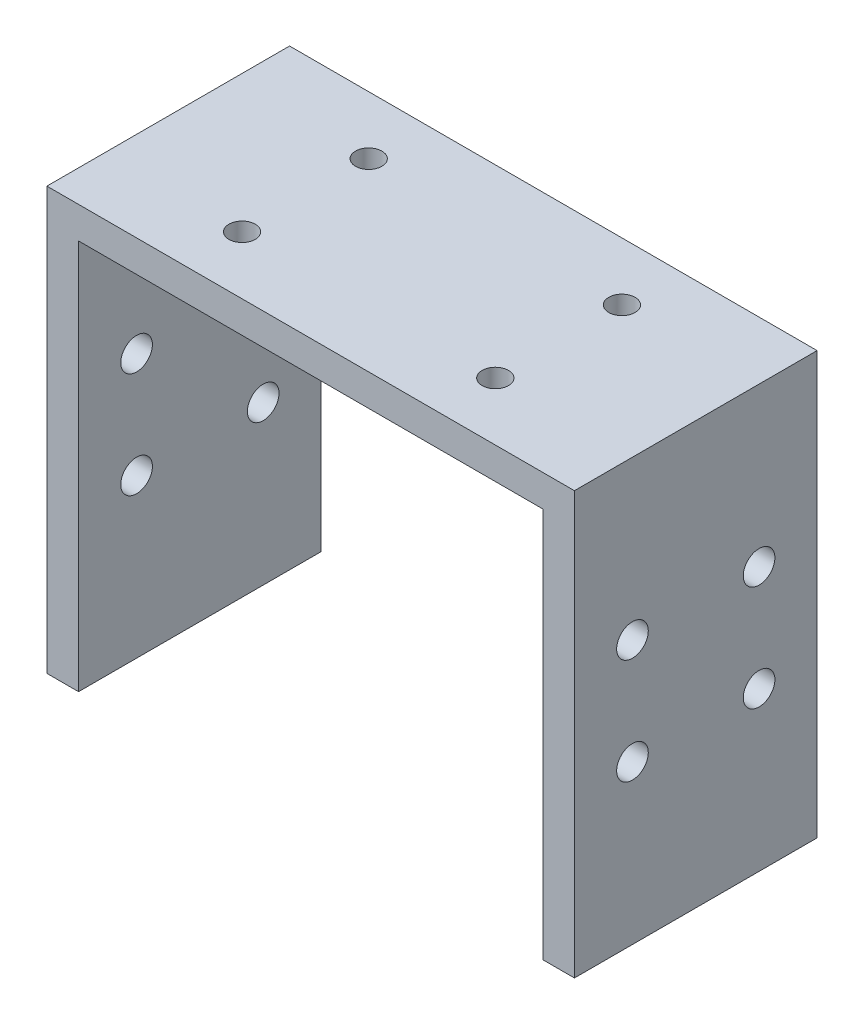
ISO-10303-21;
HEADER;
FILE_DESCRIPTION(('STEP AP214'),'2;1');
FILE_NAME('part.step','',(''),(''),'','','');
FILE_SCHEMA(('AUTOMOTIVE_DESIGN { 1 0 10303 214 1 1 1 1 }'));
ENDSEC;
DATA;
#1=APPLICATION_CONTEXT('core data for automotive mechanical design processes');
#2=APPLICATION_PROTOCOL_DEFINITION('international standard','automotive_design',2000,#1);
#3=PRODUCT_CONTEXT('',#1,'mechanical');
#4=PRODUCT('Part','Part','',(#3));
#5=PRODUCT_RELATED_PRODUCT_CATEGORY('part','',(#4));
#6=PRODUCT_DEFINITION_FORMATION('','',#4);
#7=PRODUCT_DEFINITION_CONTEXT('part definition',#1,'design');
#8=PRODUCT_DEFINITION('design','',#6,#7);
#9=PRODUCT_DEFINITION_SHAPE('','',#8);
#10=(LENGTH_UNIT() NAMED_UNIT(*) SI_UNIT(.MILLI.,.METRE.));
#11=(NAMED_UNIT(*) PLANE_ANGLE_UNIT() SI_UNIT($,.RADIAN.));
#12=(NAMED_UNIT(*) SI_UNIT($,.STERADIAN.) SOLID_ANGLE_UNIT());
#13=UNCERTAINTY_MEASURE_WITH_UNIT(LENGTH_MEASURE(1.E-05),#10,'distance_accuracy_value','');
#14=(GEOMETRIC_REPRESENTATION_CONTEXT(3) GLOBAL_UNCERTAINTY_ASSIGNED_CONTEXT((#13)) GLOBAL_UNIT_ASSIGNED_CONTEXT((#10,
#11,#12)) REPRESENTATION_CONTEXT('',''));
#15=CARTESIAN_POINT('',(0.,0.,0.));
#16=DIRECTION('',(0.,0.,1.));
#17=DIRECTION('',(1.,0.,0.));
#18=AXIS2_PLACEMENT_3D('',#15,#16,#17);
#19=CARTESIAN_POINT('',(-25.,-40.,11.5));
#20=DIRECTION('',(0.,0.,1.));
#21=DIRECTION('',(1.,0.,0.));
#22=AXIS2_PLACEMENT_3D('',#19,#20,#21);
#23=PLANE('',#22);
#24=DIRECTION('',(1.,0.,0.));
#25=VECTOR('',#24,1.);
#26=CARTESIAN_POINT('',(-25.,-40.,11.5));
#27=LINE('',#26,#25);
#28=CARTESIAN_POINT('',(-25.,-40.,11.5));
#29=VERTEX_POINT('',#28);
#30=CARTESIAN_POINT('',(-22.,-40.,11.5));
#31=VERTEX_POINT('',#30);
#32=EDGE_CURVE('E157',#29,#31,#27,.T.);
#33=ORIENTED_EDGE('',*,*,#32,.T.);
#34=DIRECTION('',(0.,1.,0.));
#35=VECTOR('',#34,1.);
#36=CARTESIAN_POINT('',(-22.,-40.,11.5));
#37=LINE('',#36,#35);
#38=CARTESIAN_POINT('',(-22.,-3.,11.5));
#39=VERTEX_POINT('',#38);
#40=EDGE_CURVE('E58',#31,#39,#37,.T.);
#41=ORIENTED_EDGE('',*,*,#40,.T.);
#42=DIRECTION('',(1.,0.,0.));
#43=VECTOR('',#42,1.);
#44=CARTESIAN_POINT('',(-25.,-3.,11.5));
#45=LINE('',#44,#43);
#46=CARTESIAN_POINT('',(22.,-3.,11.5));
#47=VERTEX_POINT('',#46);
#48=EDGE_CURVE('E128',#39,#47,#45,.T.);
#49=ORIENTED_EDGE('',*,*,#48,.T.);
#50=DIRECTION('',(0.,1.,0.));
#51=VECTOR('',#50,1.);
#52=CARTESIAN_POINT('',(22.,-40.,11.5));
#53=LINE('',#52,#51);
#54=CARTESIAN_POINT('',(22.,-40.,11.5));
#55=VERTEX_POINT('',#54);
#56=EDGE_CURVE('E114',#55,#47,#53,.T.);
#57=ORIENTED_EDGE('',*,*,#56,.F.);
#58=CARTESIAN_POINT('',(25.,-40.,11.5));
#59=VERTEX_POINT('',#58);
#60=EDGE_CURVE('E66',#55,#59,#27,.T.);
#61=ORIENTED_EDGE('',*,*,#60,.T.);
#62=DIRECTION('',(0.,1.,0.));
#63=VECTOR('',#62,1.);
#64=CARTESIAN_POINT('',(25.,-40.,11.5));
#65=LINE('',#64,#63);
#66=CARTESIAN_POINT('',(25.,0.,11.5));
#67=VERTEX_POINT('',#66);
#68=EDGE_CURVE('E11',#59,#67,#65,.T.);
#69=ORIENTED_EDGE('',*,*,#68,.T.);
#70=DIRECTION('',(1.,0.,0.));
#71=VECTOR('',#70,1.);
#72=CARTESIAN_POINT('',(-25.,0.,11.5));
#73=LINE('',#72,#71);
#74=CARTESIAN_POINT('',(-25.,0.,11.5));
#75=VERTEX_POINT('',#74);
#76=EDGE_CURVE('E151',#75,#67,#73,.T.);
#77=ORIENTED_EDGE('',*,*,#76,.F.);
#78=DIRECTION('',(0.,1.,0.));
#79=VECTOR('',#78,1.);
#80=CARTESIAN_POINT('',(-25.,-40.,11.5));
#81=LINE('',#80,#79);
#82=EDGE_CURVE('E50',#29,#75,#81,.T.);
#83=ORIENTED_EDGE('',*,*,#82,.F.);
#84=EDGE_LOOP('',(#33,#41,#49,#57,#61,#69,#77,#83));
#85=FACE_BOUND('',#84,.T.);
#86=ADVANCED_FACE('F41',(#85),#23,.T.);
#87=CARTESIAN_POINT('',(-25.,-40.,-11.5));
#88=DIRECTION('',(0.,0.,-1.));
#89=DIRECTION('',(-1.,0.,0.));
#90=AXIS2_PLACEMENT_3D('',#87,#88,#89);
#91=PLANE('',#90);
#92=DIRECTION('',(-1.,0.,0.));
#93=VECTOR('',#92,1.);
#94=CARTESIAN_POINT('',(-25.,-40.,-11.5));
#95=LINE('',#94,#93);
#96=CARTESIAN_POINT('',(25.,-40.,-11.5));
#97=VERTEX_POINT('',#96);
#98=CARTESIAN_POINT('',(22.,-40.,-11.5));
#99=VERTEX_POINT('',#98);
#100=EDGE_CURVE('E152',#97,#99,#95,.T.);
#101=ORIENTED_EDGE('',*,*,#100,.T.);
#102=DIRECTION('',(0.,1.,0.));
#103=VECTOR('',#102,1.);
#104=CARTESIAN_POINT('',(22.,-40.,-11.5));
#105=LINE('',#104,#103);
#106=CARTESIAN_POINT('',(22.,-3.,-11.5));
#107=VERTEX_POINT('',#106);
#108=EDGE_CURVE('E143',#99,#107,#105,.T.);
#109=ORIENTED_EDGE('',*,*,#108,.T.);
#110=DIRECTION('',(-1.,0.,0.));
#111=VECTOR('',#110,1.);
#112=CARTESIAN_POINT('',(-25.,-3.,-11.5));
#113=LINE('',#112,#111);
#114=CARTESIAN_POINT('',(-22.,-3.,-11.5));
#115=VERTEX_POINT('',#114);
#116=EDGE_CURVE('E130',#107,#115,#113,.T.);
#117=ORIENTED_EDGE('',*,*,#116,.T.);
#118=DIRECTION('',(0.,1.,0.));
#119=VECTOR('',#118,1.);
#120=CARTESIAN_POINT('',(-22.,-40.,-11.5));
#121=LINE('',#120,#119);
#122=CARTESIAN_POINT('',(-22.,-40.,-11.5));
#123=VERTEX_POINT('',#122);
#124=EDGE_CURVE('E141',#123,#115,#121,.T.);
#125=ORIENTED_EDGE('',*,*,#124,.F.);
#126=CARTESIAN_POINT('',(-25.,-40.,-11.5));
#127=VERTEX_POINT('',#126);
#128=EDGE_CURVE('E150',#123,#127,#95,.T.);
#129=ORIENTED_EDGE('',*,*,#128,.T.);
#130=DIRECTION('',(0.,1.,0.));
#131=VECTOR('',#130,1.);
#132=CARTESIAN_POINT('',(-25.,-40.,-11.5));
#133=LINE('',#132,#131);
#134=CARTESIAN_POINT('',(-25.,0.,-11.5));
#135=VERTEX_POINT('',#134);
#136=EDGE_CURVE('E170',#127,#135,#133,.T.);
#137=ORIENTED_EDGE('',*,*,#136,.T.);
#138=DIRECTION('',(-1.,0.,0.));
#139=VECTOR('',#138,1.);
#140=CARTESIAN_POINT('',(-25.,0.,-11.5));
#141=LINE('',#140,#139);
#142=CARTESIAN_POINT('',(25.,0.,-11.5));
#143=VERTEX_POINT('',#142);
#144=EDGE_CURVE('E161',#143,#135,#141,.T.);
#145=ORIENTED_EDGE('',*,*,#144,.F.);
#146=DIRECTION('',(0.,1.,0.));
#147=VECTOR('',#146,1.);
#148=CARTESIAN_POINT('',(25.,-40.,-11.5));
#149=LINE('',#148,#147);
#150=EDGE_CURVE('E91',#97,#143,#149,.T.);
#151=ORIENTED_EDGE('',*,*,#150,.F.);
#152=EDGE_LOOP('',(#101,#109,#117,#125,#129,#137,#145,#151));
#153=FACE_BOUND('',#152,.T.);
#154=ADVANCED_FACE('F238',(#153),#91,.T.);
#155=CARTESIAN_POINT('',(0.,-40.,0.));
#156=DIRECTION('',(0.,-1.,0.));
#157=DIRECTION('',(0.,0.,-1.));
#158=AXIS2_PLACEMENT_3D('',#155,#156,#157);
#159=PLANE('',#158);
#160=ORIENTED_EDGE('',*,*,#60,.F.);
#161=DIRECTION('',(0.,0.,-1.));
#162=VECTOR('',#161,1.);
#163=CARTESIAN_POINT('',(22.,-40.,11.5));
#164=LINE('',#163,#162);
#165=EDGE_CURVE('E120',#55,#99,#164,.T.);
#166=ORIENTED_EDGE('',*,*,#165,.T.);
#167=ORIENTED_EDGE('',*,*,#100,.F.);
#168=DIRECTION('',(0.,0.,-1.));
#169=VECTOR('',#168,1.);
#170=CARTESIAN_POINT('',(25.,-40.,11.5));
#171=LINE('',#170,#169);
#172=EDGE_CURVE('E147',#59,#97,#171,.T.);
#173=ORIENTED_EDGE('',*,*,#172,.F.);
#174=EDGE_LOOP('',(#160,#166,#167,#173));
#175=FACE_BOUND('',#174,.T.);
#176=ADVANCED_FACE('F250',(#175),#159,.T.);
#177=ORIENTED_EDGE('',*,*,#128,.F.);
#178=DIRECTION('',(0.,0.,1.));
#179=VECTOR('',#178,1.);
#180=CARTESIAN_POINT('',(-22.,-40.,11.5));
#181=LINE('',#180,#179);
#182=EDGE_CURVE('E136',#123,#31,#181,.T.);
#183=ORIENTED_EDGE('',*,*,#182,.T.);
#184=ORIENTED_EDGE('',*,*,#32,.F.);
#185=DIRECTION('',(0.,0.,1.));
#186=VECTOR('',#185,1.);
#187=CARTESIAN_POINT('',(-25.,-40.,11.5));
#188=LINE('',#187,#186);
#189=EDGE_CURVE('E154',#127,#29,#188,.T.);
#190=ORIENTED_EDGE('',*,*,#189,.F.);
#191=EDGE_LOOP('',(#177,#183,#184,#190));
#192=FACE_BOUND('',#191,.T.);
#193=ADVANCED_FACE('F247',(#192),#159,.T.);
#194=CARTESIAN_POINT('',(25.,-40.,11.5));
#195=DIRECTION('',(1.,0.,0.));
#196=DIRECTION('',(0.,0.,-1.));
#197=AXIS2_PLACEMENT_3D('',#194,#195,#196);
#198=PLANE('',#197);
#199=CARTESIAN_POINT('',(25.,-15.,-6.));
#200=DIRECTION('',(1.,0.,0.));
#201=DIRECTION('',(0.,0.,-1.));
#202=AXIS2_PLACEMENT_3D('',#199,#200,#201);
#203=CIRCLE('',#202,1.5);
#204=CARTESIAN_POINT('',(25.,-15.,-7.5));
#205=VERTEX_POINT('',#204);
#206=EDGE_CURVE('E287',#205,#205,#203,.T.);
#207=ORIENTED_EDGE('',*,*,#206,.F.);
#208=EDGE_LOOP('',(#207));
#209=FACE_BOUND('',#208,.T.);
#210=CARTESIAN_POINT('',(25.,-25.,6.));
#211=DIRECTION('',(1.,0.,0.));
#212=DIRECTION('',(0.,0.,-1.));
#213=AXIS2_PLACEMENT_3D('',#210,#211,#212);
#214=CIRCLE('',#213,1.5);
#215=CARTESIAN_POINT('',(25.,-25.,4.5));
#216=VERTEX_POINT('',#215);
#217=EDGE_CURVE('E290',#216,#216,#214,.T.);
#218=ORIENTED_EDGE('',*,*,#217,.F.);
#219=EDGE_LOOP('',(#218));
#220=FACE_BOUND('',#219,.T.);
#221=CARTESIAN_POINT('',(25.,-25.,-6.));
#222=DIRECTION('',(1.,0.,0.));
#223=DIRECTION('',(0.,0.,-1.));
#224=AXIS2_PLACEMENT_3D('',#221,#222,#223);
#225=CIRCLE('',#224,1.5);
#226=CARTESIAN_POINT('',(25.,-25.,-7.5));
#227=VERTEX_POINT('',#226);
#228=EDGE_CURVE('E291',#227,#227,#225,.T.);
#229=ORIENTED_EDGE('',*,*,#228,.F.);
#230=EDGE_LOOP('',(#229));
#231=FACE_BOUND('',#230,.T.);
#232=CARTESIAN_POINT('',(25.,-15.,6.));
#233=DIRECTION('',(1.,0.,0.));
#234=DIRECTION('',(0.,0.,-1.));
#235=AXIS2_PLACEMENT_3D('',#232,#233,#234);
#236=CIRCLE('',#235,1.5);
#237=CARTESIAN_POINT('',(25.,-15.,4.5));
#238=VERTEX_POINT('',#237);
#239=EDGE_CURVE('E284',#238,#238,#236,.T.);
#240=ORIENTED_EDGE('',*,*,#239,.F.);
#241=EDGE_LOOP('',(#240));
#242=FACE_BOUND('',#241,.T.);
#243=DIRECTION('',(0.,0.,-1.));
#244=VECTOR('',#243,1.);
#245=CARTESIAN_POINT('',(25.,0.,11.5));
#246=LINE('',#245,#244);
#247=EDGE_CURVE('E122',#67,#143,#246,.T.);
#248=ORIENTED_EDGE('',*,*,#247,.F.);
#249=ORIENTED_EDGE('',*,*,#68,.F.);
#250=ORIENTED_EDGE('',*,*,#172,.T.);
#251=ORIENTED_EDGE('',*,*,#150,.T.);
#252=EDGE_LOOP('',(#248,#249,#250,#251));
#253=FACE_BOUND('',#252,.T.);
#254=ADVANCED_FACE('F43',(#209,#220,#231,#242,#253),#198,.T.);
#255=CARTESIAN_POINT('',(-25.,-40.,11.5));
#256=DIRECTION('',(-1.,0.,0.));
#257=DIRECTION('',(0.,0.,1.));
#258=AXIS2_PLACEMENT_3D('',#255,#256,#257);
#259=PLANE('',#258);
#260=CARTESIAN_POINT('',(-25.,-15.,-6.));
#261=DIRECTION('',(1.,0.,0.));
#262=DIRECTION('',(0.,0.,-1.));
#263=AXIS2_PLACEMENT_3D('',#260,#261,#262);
#264=CIRCLE('',#263,1.5);
#265=CARTESIAN_POINT('',(-25.,-15.,-7.5));
#266=VERTEX_POINT('',#265);
#267=EDGE_CURVE('E272',#266,#266,#264,.T.);
#268=ORIENTED_EDGE('',*,*,#267,.T.);
#269=EDGE_LOOP('',(#268));
#270=FACE_BOUND('',#269,.T.);
#271=CARTESIAN_POINT('',(-25.,-25.,6.));
#272=DIRECTION('',(1.,0.,0.));
#273=DIRECTION('',(0.,0.,-1.));
#274=AXIS2_PLACEMENT_3D('',#271,#272,#273);
#275=CIRCLE('',#274,1.5);
#276=CARTESIAN_POINT('',(-25.,-25.,4.5));
#277=VERTEX_POINT('',#276);
#278=EDGE_CURVE('E276',#277,#277,#275,.T.);
#279=ORIENTED_EDGE('',*,*,#278,.T.);
#280=EDGE_LOOP('',(#279));
#281=FACE_BOUND('',#280,.T.);
#282=CARTESIAN_POINT('',(-25.,-25.,-6.));
#283=DIRECTION('',(1.,0.,0.));
#284=DIRECTION('',(0.,0.,-1.));
#285=AXIS2_PLACEMENT_3D('',#282,#283,#284);
#286=CIRCLE('',#285,1.5);
#287=CARTESIAN_POINT('',(-25.,-25.,-7.5));
#288=VERTEX_POINT('',#287);
#289=EDGE_CURVE('E280',#288,#288,#286,.T.);
#290=ORIENTED_EDGE('',*,*,#289,.T.);
#291=EDGE_LOOP('',(#290));
#292=FACE_BOUND('',#291,.T.);
#293=CARTESIAN_POINT('',(-25.,-15.,6.));
#294=DIRECTION('',(1.,0.,0.));
#295=DIRECTION('',(0.,0.,-1.));
#296=AXIS2_PLACEMENT_3D('',#293,#294,#295);
#297=CIRCLE('',#296,1.5);
#298=CARTESIAN_POINT('',(-25.,-15.,4.5));
#299=VERTEX_POINT('',#298);
#300=EDGE_CURVE('E177',#299,#299,#297,.T.);
#301=ORIENTED_EDGE('',*,*,#300,.T.);
#302=EDGE_LOOP('',(#301));
#303=FACE_BOUND('',#302,.T.);
#304=DIRECTION('',(0.,0.,1.));
#305=VECTOR('',#304,1.);
#306=CARTESIAN_POINT('',(-25.,0.,11.5));
#307=LINE('',#306,#305);
#308=EDGE_CURVE('E164',#135,#75,#307,.T.);
#309=ORIENTED_EDGE('',*,*,#308,.F.);
#310=ORIENTED_EDGE('',*,*,#136,.F.);
#311=ORIENTED_EDGE('',*,*,#189,.T.);
#312=ORIENTED_EDGE('',*,*,#82,.T.);
#313=EDGE_LOOP('',(#309,#310,#311,#312));
#314=FACE_BOUND('',#313,.T.);
#315=ADVANCED_FACE('F233',(#270,#281,#292,#303,#314),#259,.T.);
#316=CARTESIAN_POINT('',(0.,0.,0.));
#317=DIRECTION('',(0.,-1.,0.));
#318=DIRECTION('',(0.,0.,-1.));
#319=AXIS2_PLACEMENT_3D('',#316,#317,#318);
#320=PLANE('',#319);
#321=CARTESIAN_POINT('',(12.,0.,6.));
#322=DIRECTION('',(0.,1.,0.));
#323=DIRECTION('',(0.,0.,1.));
#324=AXIS2_PLACEMENT_3D('',#321,#322,#323);
#325=CIRCLE('',#324,1.25);
#326=CARTESIAN_POINT('',(12.,0.,7.25));
#327=VERTEX_POINT('',#326);
#328=EDGE_CURVE('E209',#327,#327,#325,.T.);
#329=ORIENTED_EDGE('',*,*,#328,.F.);
#330=EDGE_LOOP('',(#329));
#331=FACE_BOUND('',#330,.T.);
#332=CARTESIAN_POINT('',(-12.,0.,-5.99999999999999));
#333=DIRECTION('',(0.,1.,0.));
#334=DIRECTION('',(0.,0.,1.));
#335=AXIS2_PLACEMENT_3D('',#332,#333,#334);
#336=CIRCLE('',#335,1.25);
#337=CARTESIAN_POINT('',(-12.,0.,-4.74999999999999));
#338=VERTEX_POINT('',#337);
#339=EDGE_CURVE('E202',#338,#338,#336,.T.);
#340=ORIENTED_EDGE('',*,*,#339,.F.);
#341=EDGE_LOOP('',(#340));
#342=FACE_BOUND('',#341,.T.);
#343=CARTESIAN_POINT('',(-12.,0.,6.00000000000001));
#344=DIRECTION('',(0.,1.,0.));
#345=DIRECTION('',(0.,0.,1.));
#346=AXIS2_PLACEMENT_3D('',#343,#344,#345);
#347=CIRCLE('',#346,1.25);
#348=CARTESIAN_POINT('',(-12.,0.,7.25000000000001));
#349=VERTEX_POINT('',#348);
#350=EDGE_CURVE('E198',#349,#349,#347,.T.);
#351=ORIENTED_EDGE('',*,*,#350,.F.);
#352=EDGE_LOOP('',(#351));
#353=FACE_BOUND('',#352,.T.);
#354=CARTESIAN_POINT('',(12.,0.,-6.));
#355=DIRECTION('',(0.,1.,0.));
#356=DIRECTION('',(0.,0.,1.));
#357=AXIS2_PLACEMENT_3D('',#354,#355,#356);
#358=CIRCLE('',#357,1.25);
#359=CARTESIAN_POINT('',(12.,0.,-4.75));
#360=VERTEX_POINT('',#359);
#361=EDGE_CURVE('E131',#360,#360,#358,.T.);
#362=ORIENTED_EDGE('',*,*,#361,.F.);
#363=EDGE_LOOP('',(#362));
#364=FACE_BOUND('',#363,.T.);
#365=ORIENTED_EDGE('',*,*,#247,.T.);
#366=ORIENTED_EDGE('',*,*,#144,.T.);
#367=ORIENTED_EDGE('',*,*,#308,.T.);
#368=ORIENTED_EDGE('',*,*,#76,.T.);
#369=EDGE_LOOP('',(#365,#366,#367,#368));
#370=FACE_BOUND('',#369,.T.);
#371=ADVANCED_FACE('F230',(#331,#342,#353,#364,#370),#320,.F.);
#372=CARTESIAN_POINT('',(22.,-40.,11.5));
#373=DIRECTION('',(1.,0.,0.));
#374=DIRECTION('',(0.,0.,-1.));
#375=AXIS2_PLACEMENT_3D('',#372,#373,#374);
#376=PLANE('',#375);
#377=CARTESIAN_POINT('',(22.,-15.,-6.));
#378=DIRECTION('',(1.,0.,0.));
#379=DIRECTION('',(0.,0.,-1.));
#380=AXIS2_PLACEMENT_3D('',#377,#378,#379);
#381=CIRCLE('',#380,1.5);
#382=CARTESIAN_POINT('',(22.,-15.,-7.5));
#383=VERTEX_POINT('',#382);
#384=EDGE_CURVE('E195',#383,#383,#381,.T.);
#385=ORIENTED_EDGE('',*,*,#384,.T.);
#386=EDGE_LOOP('',(#385));
#387=FACE_BOUND('',#386,.T.);
#388=CARTESIAN_POINT('',(22.,-25.,6.));
#389=DIRECTION('',(1.,0.,0.));
#390=DIRECTION('',(0.,0.,-1.));
#391=AXIS2_PLACEMENT_3D('',#388,#389,#390);
#392=CIRCLE('',#391,1.5);
#393=CARTESIAN_POINT('',(22.,-25.,4.5));
#394=VERTEX_POINT('',#393);
#395=EDGE_CURVE('E183',#394,#394,#392,.T.);
#396=ORIENTED_EDGE('',*,*,#395,.T.);
#397=EDGE_LOOP('',(#396));
#398=FACE_BOUND('',#397,.T.);
#399=CARTESIAN_POINT('',(22.,-25.,-6.));
#400=DIRECTION('',(1.,0.,0.));
#401=DIRECTION('',(0.,0.,-1.));
#402=AXIS2_PLACEMENT_3D('',#399,#400,#401);
#403=CIRCLE('',#402,1.5);
#404=CARTESIAN_POINT('',(22.,-25.,-7.5));
#405=VERTEX_POINT('',#404);
#406=EDGE_CURVE('E180',#405,#405,#403,.T.);
#407=ORIENTED_EDGE('',*,*,#406,.T.);
#408=EDGE_LOOP('',(#407));
#409=FACE_BOUND('',#408,.T.);
#410=CARTESIAN_POINT('',(22.,-15.,6.));
#411=DIRECTION('',(1.,0.,0.));
#412=DIRECTION('',(0.,0.,-1.));
#413=AXIS2_PLACEMENT_3D('',#410,#411,#412);
#414=CIRCLE('',#413,1.5);
#415=CARTESIAN_POINT('',(22.,-15.,4.5));
#416=VERTEX_POINT('',#415);
#417=EDGE_CURVE('E176',#416,#416,#414,.T.);
#418=ORIENTED_EDGE('',*,*,#417,.T.);
#419=EDGE_LOOP('',(#418));
#420=FACE_BOUND('',#419,.T.);
#421=DIRECTION('',(0.,0.,-1.));
#422=VECTOR('',#421,1.);
#423=CARTESIAN_POINT('',(22.,-3.,11.5));
#424=LINE('',#423,#422);
#425=EDGE_CURVE('E117',#47,#107,#424,.T.);
#426=ORIENTED_EDGE('',*,*,#425,.T.);
#427=ORIENTED_EDGE('',*,*,#108,.F.);
#428=ORIENTED_EDGE('',*,*,#165,.F.);
#429=ORIENTED_EDGE('',*,*,#56,.T.);
#430=EDGE_LOOP('',(#426,#427,#428,#429));
#431=FACE_BOUND('',#430,.T.);
#432=ADVANCED_FACE('F116',(#387,#398,#409,#420,#431),#376,.F.);
#433=CARTESIAN_POINT('',(-22.,-40.,11.5));
#434=DIRECTION('',(-1.,0.,0.));
#435=DIRECTION('',(0.,0.,1.));
#436=AXIS2_PLACEMENT_3D('',#433,#434,#435);
#437=PLANE('',#436);
#438=CARTESIAN_POINT('',(-22.,-15.,-6.));
#439=DIRECTION('',(-1.,0.,0.));
#440=DIRECTION('',(0.,0.,1.));
#441=AXIS2_PLACEMENT_3D('',#438,#439,#440);
#442=CIRCLE('',#441,1.5);
#443=CARTESIAN_POINT('',(-22.,-15.,-4.5));
#444=VERTEX_POINT('',#443);
#445=EDGE_CURVE('E45',#444,#444,#442,.T.);
#446=ORIENTED_EDGE('',*,*,#445,.T.);
#447=EDGE_LOOP('',(#446));
#448=FACE_BOUND('',#447,.T.);
#449=CARTESIAN_POINT('',(-22.,-25.,6.));
#450=DIRECTION('',(-1.,0.,0.));
#451=DIRECTION('',(0.,0.,1.));
#452=AXIS2_PLACEMENT_3D('',#449,#450,#451);
#453=CIRCLE('',#452,1.5);
#454=CARTESIAN_POINT('',(-22.,-25.,7.5));
#455=VERTEX_POINT('',#454);
#456=EDGE_CURVE('E181',#455,#455,#453,.T.);
#457=ORIENTED_EDGE('',*,*,#456,.T.);
#458=EDGE_LOOP('',(#457));
#459=FACE_BOUND('',#458,.T.);
#460=CARTESIAN_POINT('',(-22.,-25.,-6.));
#461=DIRECTION('',(-1.,0.,0.));
#462=DIRECTION('',(0.,0.,1.));
#463=AXIS2_PLACEMENT_3D('',#460,#461,#462);
#464=CIRCLE('',#463,1.5);
#465=CARTESIAN_POINT('',(-22.,-25.,-4.5));
#466=VERTEX_POINT('',#465);
#467=EDGE_CURVE('E178',#466,#466,#464,.T.);
#468=ORIENTED_EDGE('',*,*,#467,.T.);
#469=EDGE_LOOP('',(#468));
#470=FACE_BOUND('',#469,.T.);
#471=CARTESIAN_POINT('',(-22.,-15.,6.));
#472=DIRECTION('',(-1.,0.,0.));
#473=DIRECTION('',(0.,0.,1.));
#474=AXIS2_PLACEMENT_3D('',#471,#472,#473);
#475=CIRCLE('',#474,1.5);
#476=CARTESIAN_POINT('',(-22.,-15.,7.5));
#477=VERTEX_POINT('',#476);
#478=EDGE_CURVE('E173',#477,#477,#475,.T.);
#479=ORIENTED_EDGE('',*,*,#478,.T.);
#480=EDGE_LOOP('',(#479));
#481=FACE_BOUND('',#480,.T.);
#482=DIRECTION('',(0.,0.,1.));
#483=VECTOR('',#482,1.);
#484=CARTESIAN_POINT('',(-22.,-3.,11.5));
#485=LINE('',#484,#483);
#486=EDGE_CURVE('E134',#115,#39,#485,.T.);
#487=ORIENTED_EDGE('',*,*,#486,.T.);
#488=ORIENTED_EDGE('',*,*,#40,.F.);
#489=ORIENTED_EDGE('',*,*,#182,.F.);
#490=ORIENTED_EDGE('',*,*,#124,.T.);
#491=EDGE_LOOP('',(#487,#488,#489,#490));
#492=FACE_BOUND('',#491,.T.);
#493=ADVANCED_FACE('F248',(#448,#459,#470,#481,#492),#437,.F.);
#494=CARTESIAN_POINT('',(0.,-3.,0.));
#495=DIRECTION('',(0.,-1.,0.));
#496=DIRECTION('',(0.,0.,-1.));
#497=AXIS2_PLACEMENT_3D('',#494,#495,#496);
#498=PLANE('',#497);
#499=CARTESIAN_POINT('',(12.,-3.,6.));
#500=DIRECTION('',(0.,-1.,0.));
#501=DIRECTION('',(0.,0.,-1.));
#502=AXIS2_PLACEMENT_3D('',#499,#500,#501);
#503=CIRCLE('',#502,1.25);
#504=CARTESIAN_POINT('',(12.,-3.,4.75));
#505=VERTEX_POINT('',#504);
#506=EDGE_CURVE('E205',#505,#505,#503,.F.);
#507=ORIENTED_EDGE('',*,*,#506,.T.);
#508=EDGE_LOOP('',(#507));
#509=FACE_BOUND('',#508,.T.);
#510=CARTESIAN_POINT('',(-12.,-3.,-5.99999999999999));
#511=DIRECTION('',(0.,-1.,0.));
#512=DIRECTION('',(0.,0.,-1.));
#513=AXIS2_PLACEMENT_3D('',#510,#511,#512);
#514=CIRCLE('',#513,1.25);
#515=CARTESIAN_POINT('',(-12.,-3.,-7.24999999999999));
#516=VERTEX_POINT('',#515);
#517=EDGE_CURVE('E212',#516,#516,#514,.F.);
#518=ORIENTED_EDGE('',*,*,#517,.T.);
#519=EDGE_LOOP('',(#518));
#520=FACE_BOUND('',#519,.T.);
#521=CARTESIAN_POINT('',(-12.,-3.,6.00000000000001));
#522=DIRECTION('',(0.,-1.,0.));
#523=DIRECTION('',(0.,0.,-1.));
#524=AXIS2_PLACEMENT_3D('',#521,#522,#523);
#525=CIRCLE('',#524,1.25);
#526=CARTESIAN_POINT('',(-12.,-3.,4.75000000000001));
#527=VERTEX_POINT('',#526);
#528=EDGE_CURVE('E199',#527,#527,#525,.F.);
#529=ORIENTED_EDGE('',*,*,#528,.T.);
#530=EDGE_LOOP('',(#529));
#531=FACE_BOUND('',#530,.T.);
#532=CARTESIAN_POINT('',(12.,-3.,-6.));
#533=DIRECTION('',(0.,-1.,0.));
#534=DIRECTION('',(0.,0.,-1.));
#535=AXIS2_PLACEMENT_3D('',#532,#533,#534);
#536=CIRCLE('',#535,1.25);
#537=CARTESIAN_POINT('',(12.,-3.,-7.25));
#538=VERTEX_POINT('',#537);
#539=EDGE_CURVE('E208',#538,#538,#536,.F.);
#540=ORIENTED_EDGE('',*,*,#539,.T.);
#541=EDGE_LOOP('',(#540));
#542=FACE_BOUND('',#541,.T.);
#543=ORIENTED_EDGE('',*,*,#425,.F.);
#544=ORIENTED_EDGE('',*,*,#48,.F.);
#545=ORIENTED_EDGE('',*,*,#486,.F.);
#546=ORIENTED_EDGE('',*,*,#116,.F.);
#547=EDGE_LOOP('',(#543,#544,#545,#546));
#548=FACE_BOUND('',#547,.T.);
#549=ADVANCED_FACE('F126',(#509,#520,#531,#542,#548),#498,.T.);
#550=CARTESIAN_POINT('',(12.,-40.001,-6.));
#551=DIRECTION('',(0.,1.,0.));
#552=DIRECTION('',(0.,0.,1.));
#553=AXIS2_PLACEMENT_3D('',#550,#551,#552);
#554=CYLINDRICAL_SURFACE('',#553,1.25);
#555=ORIENTED_EDGE('',*,*,#539,.F.);
#556=EDGE_LOOP('',(#555));
#557=FACE_BOUND('',#556,.T.);
#558=ORIENTED_EDGE('',*,*,#361,.T.);
#559=EDGE_LOOP('',(#558));
#560=FACE_BOUND('',#559,.T.);
#561=ADVANCED_FACE('F223',(#557,#560),#554,.F.);
#562=CARTESIAN_POINT('',(-12.,-40.001,6.00000000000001));
#563=DIRECTION('',(0.,1.,0.));
#564=DIRECTION('',(0.,0.,1.));
#565=AXIS2_PLACEMENT_3D('',#562,#563,#564);
#566=CYLINDRICAL_SURFACE('',#565,1.25);
#567=ORIENTED_EDGE('',*,*,#528,.F.);
#568=EDGE_LOOP('',(#567));
#569=FACE_BOUND('',#568,.T.);
#570=ORIENTED_EDGE('',*,*,#350,.T.);
#571=EDGE_LOOP('',(#570));
#572=FACE_BOUND('',#571,.T.);
#573=ADVANCED_FACE('F226',(#569,#572),#566,.F.);
#574=CARTESIAN_POINT('',(-12.,-40.001,-5.99999999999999));
#575=DIRECTION('',(0.,1.,0.));
#576=DIRECTION('',(0.,0.,1.));
#577=AXIS2_PLACEMENT_3D('',#574,#575,#576);
#578=CYLINDRICAL_SURFACE('',#577,1.25);
#579=ORIENTED_EDGE('',*,*,#517,.F.);
#580=EDGE_LOOP('',(#579));
#581=FACE_BOUND('',#580,.T.);
#582=ORIENTED_EDGE('',*,*,#339,.T.);
#583=EDGE_LOOP('',(#582));
#584=FACE_BOUND('',#583,.T.);
#585=ADVANCED_FACE('F338',(#581,#584),#578,.F.);
#586=CARTESIAN_POINT('',(12.,-40.001,6.));
#587=DIRECTION('',(0.,1.,0.));
#588=DIRECTION('',(0.,0.,1.));
#589=AXIS2_PLACEMENT_3D('',#586,#587,#588);
#590=CYLINDRICAL_SURFACE('',#589,1.25);
#591=ORIENTED_EDGE('',*,*,#506,.F.);
#592=EDGE_LOOP('',(#591));
#593=FACE_BOUND('',#592,.T.);
#594=ORIENTED_EDGE('',*,*,#328,.T.);
#595=EDGE_LOOP('',(#594));
#596=FACE_BOUND('',#595,.T.);
#597=ADVANCED_FACE('F345',(#593,#596),#590,.F.);
#598=CARTESIAN_POINT('',(-25.,-15.,6.));
#599=DIRECTION('',(1.,0.,0.));
#600=DIRECTION('',(0.,0.,-1.));
#601=AXIS2_PLACEMENT_3D('',#598,#599,#600);
#602=CYLINDRICAL_SURFACE('',#601,1.5);
#603=ORIENTED_EDGE('',*,*,#300,.F.);
#604=EDGE_LOOP('',(#603));
#605=FACE_BOUND('',#604,.T.);
#606=ORIENTED_EDGE('',*,*,#478,.F.);
#607=EDGE_LOOP('',(#606));
#608=FACE_BOUND('',#607,.T.);
#609=ADVANCED_FACE('F312',(#605,#608),#602,.F.);
#610=CARTESIAN_POINT('',(-25.,-25.,-6.));
#611=DIRECTION('',(1.,0.,0.));
#612=DIRECTION('',(0.,0.,-1.));
#613=AXIS2_PLACEMENT_3D('',#610,#611,#612);
#614=CYLINDRICAL_SURFACE('',#613,1.5);
#615=ORIENTED_EDGE('',*,*,#289,.F.);
#616=EDGE_LOOP('',(#615));
#617=FACE_BOUND('',#616,.T.);
#618=ORIENTED_EDGE('',*,*,#467,.F.);
#619=EDGE_LOOP('',(#618));
#620=FACE_BOUND('',#619,.T.);
#621=ADVANCED_FACE('F354',(#617,#620),#614,.F.);
#622=CARTESIAN_POINT('',(-25.,-25.,6.));
#623=DIRECTION('',(1.,0.,0.));
#624=DIRECTION('',(0.,0.,-1.));
#625=AXIS2_PLACEMENT_3D('',#622,#623,#624);
#626=CYLINDRICAL_SURFACE('',#625,1.5);
#627=ORIENTED_EDGE('',*,*,#278,.F.);
#628=EDGE_LOOP('',(#627));
#629=FACE_BOUND('',#628,.T.);
#630=ORIENTED_EDGE('',*,*,#456,.F.);
#631=EDGE_LOOP('',(#630));
#632=FACE_BOUND('',#631,.T.);
#633=ADVANCED_FACE('F363',(#629,#632),#626,.F.);
#634=CARTESIAN_POINT('',(-25.,-15.,-6.));
#635=DIRECTION('',(1.,0.,0.));
#636=DIRECTION('',(0.,0.,-1.));
#637=AXIS2_PLACEMENT_3D('',#634,#635,#636);
#638=CYLINDRICAL_SURFACE('',#637,1.5);
#639=ORIENTED_EDGE('',*,*,#267,.F.);
#640=EDGE_LOOP('',(#639));
#641=FACE_BOUND('',#640,.T.);
#642=ORIENTED_EDGE('',*,*,#445,.F.);
#643=EDGE_LOOP('',(#642));
#644=FACE_BOUND('',#643,.T.);
#645=ADVANCED_FACE('F310',(#641,#644),#638,.F.);
#646=ORIENTED_EDGE('',*,*,#239,.T.);
#647=EDGE_LOOP('',(#646));
#648=FACE_BOUND('',#647,.T.);
#649=ORIENTED_EDGE('',*,*,#417,.F.);
#650=EDGE_LOOP('',(#649));
#651=FACE_BOUND('',#650,.T.);
#652=ADVANCED_FACE('F307',(#648,#651),#602,.F.);
#653=ORIENTED_EDGE('',*,*,#228,.T.);
#654=EDGE_LOOP('',(#653));
#655=FACE_BOUND('',#654,.T.);
#656=ORIENTED_EDGE('',*,*,#406,.F.);
#657=EDGE_LOOP('',(#656));
#658=FACE_BOUND('',#657,.T.);
#659=ADVANCED_FACE('F301',(#655,#658),#614,.F.);
#660=ORIENTED_EDGE('',*,*,#217,.T.);
#661=EDGE_LOOP('',(#660));
#662=FACE_BOUND('',#661,.T.);
#663=ORIENTED_EDGE('',*,*,#395,.F.);
#664=EDGE_LOOP('',(#663));
#665=FACE_BOUND('',#664,.T.);
#666=ADVANCED_FACE('F373',(#662,#665),#626,.F.);
#667=ORIENTED_EDGE('',*,*,#206,.T.);
#668=EDGE_LOOP('',(#667));
#669=FACE_BOUND('',#668,.T.);
#670=ORIENTED_EDGE('',*,*,#384,.F.);
#671=EDGE_LOOP('',(#670));
#672=FACE_BOUND('',#671,.T.);
#673=ADVANCED_FACE('F380',(#669,#672),#638,.F.);
#674=CLOSED_SHELL('',(#86,#154,#176,#193,#254,#315,#371,#432,#493,#549,#561,#573,#585,#597,#609,
#621,#633,#645,#652,#659,#666,#673));
#675=MANIFOLD_SOLID_BREP('B2',#674);
#676=ADVANCED_BREP_SHAPE_REPRESENTATION('',(#18,#675),#14);
#677=SHAPE_DEFINITION_REPRESENTATION(#9,#676);
ENDSEC;
END-ISO-10303-21;
